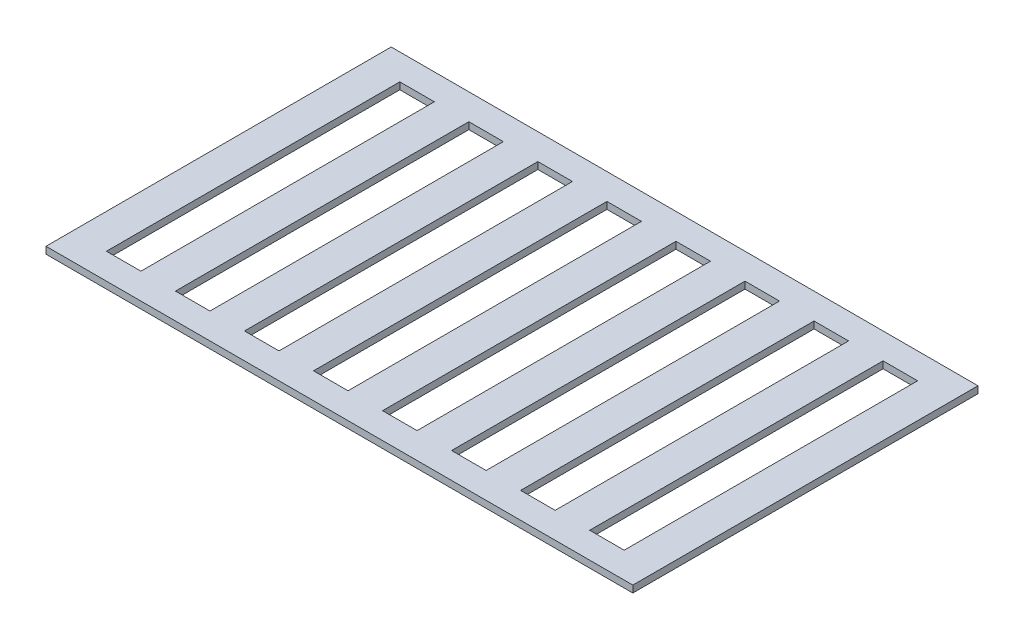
ISO-10303-21;
HEADER;
FILE_DESCRIPTION(('STEP AP214'),'2;1');
FILE_NAME('part.step','',(''),(''),'','','');
FILE_SCHEMA(('AUTOMOTIVE_DESIGN { 1 0 10303 214 1 1 1 1 }'));
ENDSEC;
DATA;
#1=APPLICATION_CONTEXT('core data for automotive mechanical design processes');
#2=APPLICATION_PROTOCOL_DEFINITION('international standard','automotive_design',2000,#1);
#3=PRODUCT_CONTEXT('',#1,'mechanical');
#4=PRODUCT('Part','Part','',(#3));
#5=PRODUCT_RELATED_PRODUCT_CATEGORY('part','',(#4));
#6=PRODUCT_DEFINITION_FORMATION('','',#4);
#7=PRODUCT_DEFINITION_CONTEXT('part definition',#1,'design');
#8=PRODUCT_DEFINITION('design','',#6,#7);
#9=PRODUCT_DEFINITION_SHAPE('','',#8);
#10=(LENGTH_UNIT() NAMED_UNIT(*) SI_UNIT(.MILLI.,.METRE.));
#11=(NAMED_UNIT(*) PLANE_ANGLE_UNIT() SI_UNIT($,.RADIAN.));
#12=(NAMED_UNIT(*) SI_UNIT($,.STERADIAN.) SOLID_ANGLE_UNIT());
#13=UNCERTAINTY_MEASURE_WITH_UNIT(LENGTH_MEASURE(1.E-05),#10,'distance_accuracy_value','');
#14=(GEOMETRIC_REPRESENTATION_CONTEXT(3) GLOBAL_UNCERTAINTY_ASSIGNED_CONTEXT((#13)) GLOBAL_UNIT_ASSIGNED_CONTEXT((#10,
#11,#12)) REPRESENTATION_CONTEXT('',''));
#15=CARTESIAN_POINT('',(0.,0.,0.));
#16=DIRECTION('',(0.,0.,1.));
#17=DIRECTION('',(1.,0.,0.));
#18=AXIS2_PLACEMENT_3D('',#15,#16,#17);
#19=CARTESIAN_POINT('',(0.,5.08,254.));
#20=DIRECTION('',(0.,1.,0.));
#21=DIRECTION('',(0.,0.,1.));
#22=AXIS2_PLACEMENT_3D('',#19,#20,#21);
#23=PLANE('',#22);
#24=DIRECTION('',(0.,0.,1.));
#25=VECTOR('',#24,1.);
#26=CARTESIAN_POINT('',(279.4,5.08,19.05));
#27=LINE('',#26,#25);
#28=CARTESIAN_POINT('',(279.4,5.08,19.05));
#29=VERTEX_POINT('',#28);
#30=CARTESIAN_POINT('',(279.4,5.08,234.95));
#31=VERTEX_POINT('',#30);
#32=EDGE_CURVE('E302',#29,#31,#27,.T.);
#33=ORIENTED_EDGE('',*,*,#32,.F.);
#34=DIRECTION('',(-1.,0.,0.));
#35=VECTOR('',#34,1.);
#36=CARTESIAN_POINT('',(279.4,5.08,19.05));
#37=LINE('',#36,#35);
#38=CARTESIAN_POINT('',(304.8,5.08,19.05));
#39=VERTEX_POINT('',#38);
#40=EDGE_CURVE('E300',#39,#29,#37,.T.);
#41=ORIENTED_EDGE('',*,*,#40,.F.);
#42=DIRECTION('',(0.,0.,-1.));
#43=VECTOR('',#42,1.);
#44=CARTESIAN_POINT('',(304.8,5.08,19.05));
#45=LINE('',#44,#43);
#46=CARTESIAN_POINT('',(304.8,5.08,234.95));
#47=VERTEX_POINT('',#46);
#48=EDGE_CURVE('E308',#47,#39,#45,.T.);
#49=ORIENTED_EDGE('',*,*,#48,.F.);
#50=DIRECTION('',(1.,0.,0.));
#51=VECTOR('',#50,1.);
#52=CARTESIAN_POINT('',(279.4,5.08,234.95));
#53=LINE('',#52,#51);
#54=EDGE_CURVE('E305',#31,#47,#53,.T.);
#55=ORIENTED_EDGE('',*,*,#54,.F.);
#56=EDGE_LOOP('',(#33,#41,#49,#55));
#57=FACE_BOUND('',#56,.T.);
#58=DIRECTION('',(0.,0.,1.));
#59=VECTOR('',#58,1.);
#60=CARTESIAN_POINT('',(177.8,5.08,19.05));
#61=LINE('',#60,#59);
#62=CARTESIAN_POINT('',(177.8,5.08,19.05));
#63=VERTEX_POINT('',#62);
#64=CARTESIAN_POINT('',(177.8,5.08,234.95));
#65=VERTEX_POINT('',#64);
#66=EDGE_CURVE('E364',#63,#65,#61,.T.);
#67=ORIENTED_EDGE('',*,*,#66,.F.);
#68=DIRECTION('',(-1.,0.,0.));
#69=VECTOR('',#68,1.);
#70=CARTESIAN_POINT('',(177.8,5.08,19.05));
#71=LINE('',#70,#69);
#72=CARTESIAN_POINT('',(203.2,5.08,19.05));
#73=VERTEX_POINT('',#72);
#74=EDGE_CURVE('E362',#73,#63,#71,.T.);
#75=ORIENTED_EDGE('',*,*,#74,.F.);
#76=DIRECTION('',(0.,0.,-1.));
#77=VECTOR('',#76,1.);
#78=CARTESIAN_POINT('',(203.2,5.08,19.05));
#79=LINE('',#78,#77);
#80=CARTESIAN_POINT('',(203.2,5.08,234.95));
#81=VERTEX_POINT('',#80);
#82=EDGE_CURVE('E370',#81,#73,#79,.T.);
#83=ORIENTED_EDGE('',*,*,#82,.F.);
#84=DIRECTION('',(1.,0.,0.));
#85=VECTOR('',#84,1.);
#86=CARTESIAN_POINT('',(177.8,5.08,234.95));
#87=LINE('',#86,#85);
#88=EDGE_CURVE('E367',#65,#81,#87,.T.);
#89=ORIENTED_EDGE('',*,*,#88,.F.);
#90=EDGE_LOOP('',(#67,#75,#83,#89));
#91=FACE_BOUND('',#90,.T.);
#92=DIRECTION('',(0.,0.,1.));
#93=VECTOR('',#92,1.);
#94=CARTESIAN_POINT('',(76.2,5.08,19.05));
#95=LINE('',#94,#93);
#96=CARTESIAN_POINT('',(76.2,5.08,19.05));
#97=VERTEX_POINT('',#96);
#98=CARTESIAN_POINT('',(76.2,5.08,234.95));
#99=VERTEX_POINT('',#98);
#100=EDGE_CURVE('E426',#97,#99,#95,.T.);
#101=ORIENTED_EDGE('',*,*,#100,.F.);
#102=DIRECTION('',(-1.,0.,0.));
#103=VECTOR('',#102,1.);
#104=CARTESIAN_POINT('',(76.2,5.08,19.05));
#105=LINE('',#104,#103);
#106=CARTESIAN_POINT('',(101.6,5.08,19.05));
#107=VERTEX_POINT('',#106);
#108=EDGE_CURVE('E424',#107,#97,#105,.T.);
#109=ORIENTED_EDGE('',*,*,#108,.F.);
#110=DIRECTION('',(0.,0.,-1.));
#111=VECTOR('',#110,1.);
#112=CARTESIAN_POINT('',(101.6,5.08,19.05));
#113=LINE('',#112,#111);
#114=CARTESIAN_POINT('',(101.6,5.08,234.95));
#115=VERTEX_POINT('',#114);
#116=EDGE_CURVE('E432',#115,#107,#113,.T.);
#117=ORIENTED_EDGE('',*,*,#116,.F.);
#118=DIRECTION('',(1.,0.,0.));
#119=VECTOR('',#118,1.);
#120=CARTESIAN_POINT('',(76.2,5.08,234.95));
#121=LINE('',#120,#119);
#122=EDGE_CURVE('E429',#99,#115,#121,.T.);
#123=ORIENTED_EDGE('',*,*,#122,.F.);
#124=EDGE_LOOP('',(#101,#109,#117,#123));
#125=FACE_BOUND('',#124,.T.);
#126=DIRECTION('',(1.,0.,0.));
#127=VECTOR('',#126,1.);
#128=CARTESIAN_POINT('',(25.4,5.08,234.95));
#129=LINE('',#128,#127);
#130=CARTESIAN_POINT('',(25.4,5.08,234.95));
#131=VERTEX_POINT('',#130);
#132=CARTESIAN_POINT('',(50.8,5.08,234.95));
#133=VERTEX_POINT('',#132);
#134=EDGE_CURVE('E488',#131,#133,#129,.T.);
#135=ORIENTED_EDGE('',*,*,#134,.F.);
#136=DIRECTION('',(0.,0.,1.));
#137=VECTOR('',#136,1.);
#138=CARTESIAN_POINT('',(25.4,5.08,19.05));
#139=LINE('',#138,#137);
#140=CARTESIAN_POINT('',(25.4,5.08,19.05));
#141=VERTEX_POINT('',#140);
#142=EDGE_CURVE('E486',#141,#131,#139,.T.);
#143=ORIENTED_EDGE('',*,*,#142,.F.);
#144=DIRECTION('',(-1.,0.,0.));
#145=VECTOR('',#144,1.);
#146=CARTESIAN_POINT('',(25.4,5.08,19.05));
#147=LINE('',#146,#145);
#148=CARTESIAN_POINT('',(50.8,5.08,19.05));
#149=VERTEX_POINT('',#148);
#150=EDGE_CURVE('E494',#149,#141,#147,.T.);
#151=ORIENTED_EDGE('',*,*,#150,.F.);
#152=DIRECTION('',(0.,0.,-1.));
#153=VECTOR('',#152,1.);
#154=CARTESIAN_POINT('',(50.8,5.08,19.05));
#155=LINE('',#154,#153);
#156=EDGE_CURVE('E491',#133,#149,#155,.T.);
#157=ORIENTED_EDGE('',*,*,#156,.F.);
#158=EDGE_LOOP('',(#135,#143,#151,#157));
#159=FACE_BOUND('',#158,.T.);
#160=DIRECTION('',(0.,0.,1.));
#161=VECTOR('',#160,1.);
#162=CARTESIAN_POINT('',(0.,5.08,0.));
#163=LINE('',#162,#161);
#164=CARTESIAN_POINT('',(0.,5.08,0.));
#165=VERTEX_POINT('',#164);
#166=CARTESIAN_POINT('',(0.,5.08,254.));
#167=VERTEX_POINT('',#166);
#168=EDGE_CURVE('E517',#165,#167,#163,.T.);
#169=ORIENTED_EDGE('',*,*,#168,.T.);
#170=DIRECTION('',(1.,0.,0.));
#171=VECTOR('',#170,1.);
#172=CARTESIAN_POINT('',(0.,5.08,254.));
#173=LINE('',#172,#171);
#174=CARTESIAN_POINT('',(431.8,5.08,254.));
#175=VERTEX_POINT('',#174);
#176=EDGE_CURVE('E520',#167,#175,#173,.T.);
#177=ORIENTED_EDGE('',*,*,#176,.T.);
#178=DIRECTION('',(0.,0.,-1.));
#179=VECTOR('',#178,1.);
#180=CARTESIAN_POINT('',(431.8,5.08,0.));
#181=LINE('',#180,#179);
#182=CARTESIAN_POINT('',(431.8,5.08,0.));
#183=VERTEX_POINT('',#182);
#184=EDGE_CURVE('E523',#175,#183,#181,.T.);
#185=ORIENTED_EDGE('',*,*,#184,.T.);
#186=DIRECTION('',(-1.,0.,0.));
#187=VECTOR('',#186,1.);
#188=CARTESIAN_POINT('',(0.,5.08,0.));
#189=LINE('',#188,#187);
#190=EDGE_CURVE('E525',#183,#165,#189,.T.);
#191=ORIENTED_EDGE('',*,*,#190,.T.);
#192=EDGE_LOOP('',(#169,#177,#185,#191));
#193=FACE_BOUND('',#192,.T.);
#194=DIRECTION('',(0.,0.,-1.));
#195=VECTOR('',#194,1.);
#196=CARTESIAN_POINT('',(406.4,5.08,19.05));
#197=LINE('',#196,#195);
#198=CARTESIAN_POINT('',(406.4,5.08,234.95));
#199=VERTEX_POINT('',#198);
#200=CARTESIAN_POINT('',(406.4,5.08,19.05));
#201=VERTEX_POINT('',#200);
#202=EDGE_CURVE('E457',#199,#201,#197,.T.);
#203=ORIENTED_EDGE('',*,*,#202,.F.);
#204=DIRECTION('',(1.,0.,0.));
#205=VECTOR('',#204,1.);
#206=CARTESIAN_POINT('',(381.,5.08,234.95));
#207=LINE('',#206,#205);
#208=CARTESIAN_POINT('',(381.,5.08,234.95));
#209=VERTEX_POINT('',#208);
#210=EDGE_CURVE('E455',#209,#199,#207,.T.);
#211=ORIENTED_EDGE('',*,*,#210,.F.);
#212=DIRECTION('',(0.,0.,1.));
#213=VECTOR('',#212,1.);
#214=CARTESIAN_POINT('',(381.,5.08,19.05));
#215=LINE('',#214,#213);
#216=CARTESIAN_POINT('',(381.,5.08,19.05));
#217=VERTEX_POINT('',#216);
#218=EDGE_CURVE('E463',#217,#209,#215,.T.);
#219=ORIENTED_EDGE('',*,*,#218,.F.);
#220=DIRECTION('',(-1.,0.,0.));
#221=VECTOR('',#220,1.);
#222=CARTESIAN_POINT('',(381.,5.08,19.05));
#223=LINE('',#222,#221);
#224=EDGE_CURVE('E460',#201,#217,#223,.T.);
#225=ORIENTED_EDGE('',*,*,#224,.F.);
#226=EDGE_LOOP('',(#203,#211,#219,#225));
#227=FACE_BOUND('',#226,.T.);
#228=DIRECTION('',(0.,0.,1.));
#229=VECTOR('',#228,1.);
#230=CARTESIAN_POINT('',(127.,5.08,19.05));
#231=LINE('',#230,#229);
#232=CARTESIAN_POINT('',(127.,5.08,19.05));
#233=VERTEX_POINT('',#232);
#234=CARTESIAN_POINT('',(127.,5.08,234.95));
#235=VERTEX_POINT('',#234);
#236=EDGE_CURVE('E395',#233,#235,#231,.T.);
#237=ORIENTED_EDGE('',*,*,#236,.F.);
#238=DIRECTION('',(-1.,0.,0.));
#239=VECTOR('',#238,1.);
#240=CARTESIAN_POINT('',(127.,5.08,19.05));
#241=LINE('',#240,#239);
#242=CARTESIAN_POINT('',(152.4,5.08,19.05));
#243=VERTEX_POINT('',#242);
#244=EDGE_CURVE('E393',#243,#233,#241,.T.);
#245=ORIENTED_EDGE('',*,*,#244,.F.);
#246=DIRECTION('',(0.,0.,-1.));
#247=VECTOR('',#246,1.);
#248=CARTESIAN_POINT('',(152.4,5.08,19.05));
#249=LINE('',#248,#247);
#250=CARTESIAN_POINT('',(152.4,5.08,234.95));
#251=VERTEX_POINT('',#250);
#252=EDGE_CURVE('E401',#251,#243,#249,.T.);
#253=ORIENTED_EDGE('',*,*,#252,.F.);
#254=DIRECTION('',(1.,0.,0.));
#255=VECTOR('',#254,1.);
#256=CARTESIAN_POINT('',(127.,5.08,234.95));
#257=LINE('',#256,#255);
#258=EDGE_CURVE('E398',#235,#251,#257,.T.);
#259=ORIENTED_EDGE('',*,*,#258,.F.);
#260=EDGE_LOOP('',(#237,#245,#253,#259));
#261=FACE_BOUND('',#260,.T.);
#262=DIRECTION('',(0.,0.,1.));
#263=VECTOR('',#262,1.);
#264=CARTESIAN_POINT('',(228.6,5.08,19.05));
#265=LINE('',#264,#263);
#266=CARTESIAN_POINT('',(228.6,5.08,19.05));
#267=VERTEX_POINT('',#266);
#268=CARTESIAN_POINT('',(228.6,5.08,234.95));
#269=VERTEX_POINT('',#268);
#270=EDGE_CURVE('E333',#267,#269,#265,.T.);
#271=ORIENTED_EDGE('',*,*,#270,.F.);
#272=DIRECTION('',(-1.,0.,0.));
#273=VECTOR('',#272,1.);
#274=CARTESIAN_POINT('',(228.6,5.08,19.05));
#275=LINE('',#274,#273);
#276=CARTESIAN_POINT('',(254.,5.08,19.05));
#277=VERTEX_POINT('',#276);
#278=EDGE_CURVE('E331',#277,#267,#275,.T.);
#279=ORIENTED_EDGE('',*,*,#278,.F.);
#280=DIRECTION('',(0.,0.,-1.));
#281=VECTOR('',#280,1.);
#282=CARTESIAN_POINT('',(254.,5.08,19.05));
#283=LINE('',#282,#281);
#284=CARTESIAN_POINT('',(254.,5.08,234.95));
#285=VERTEX_POINT('',#284);
#286=EDGE_CURVE('E339',#285,#277,#283,.T.);
#287=ORIENTED_EDGE('',*,*,#286,.F.);
#288=DIRECTION('',(1.,0.,0.));
#289=VECTOR('',#288,1.);
#290=CARTESIAN_POINT('',(228.6,5.08,234.95));
#291=LINE('',#290,#289);
#292=EDGE_CURVE('E336',#269,#285,#291,.T.);
#293=ORIENTED_EDGE('',*,*,#292,.F.);
#294=EDGE_LOOP('',(#271,#279,#287,#293));
#295=FACE_BOUND('',#294,.T.);
#296=DIRECTION('',(0.,0.,1.));
#297=VECTOR('',#296,1.);
#298=CARTESIAN_POINT('',(330.2,5.08,19.05));
#299=LINE('',#298,#297);
#300=CARTESIAN_POINT('',(330.2,5.08,19.05));
#301=VERTEX_POINT('',#300);
#302=CARTESIAN_POINT('',(330.2,5.08,234.95));
#303=VERTEX_POINT('',#302);
#304=EDGE_CURVE('E272',#301,#303,#299,.T.);
#305=ORIENTED_EDGE('',*,*,#304,.F.);
#306=DIRECTION('',(-1.,0.,0.));
#307=VECTOR('',#306,1.);
#308=CARTESIAN_POINT('',(330.2,5.08,19.05));
#309=LINE('',#308,#307);
#310=CARTESIAN_POINT('',(355.6,5.08,19.05));
#311=VERTEX_POINT('',#310);
#312=EDGE_CURVE('E264',#311,#301,#309,.T.);
#313=ORIENTED_EDGE('',*,*,#312,.F.);
#314=DIRECTION('',(0.,0.,-1.));
#315=VECTOR('',#314,1.);
#316=CARTESIAN_POINT('',(355.6,5.08,19.05));
#317=LINE('',#316,#315);
#318=CARTESIAN_POINT('',(355.6,5.08,234.95));
#319=VERTEX_POINT('',#318);
#320=EDGE_CURVE('E286',#319,#311,#317,.T.);
#321=ORIENTED_EDGE('',*,*,#320,.F.);
#322=DIRECTION('',(1.,0.,0.));
#323=VECTOR('',#322,1.);
#324=CARTESIAN_POINT('',(330.2,5.08,234.95));
#325=LINE('',#324,#323);
#326=EDGE_CURVE('E284',#303,#319,#325,.T.);
#327=ORIENTED_EDGE('',*,*,#326,.F.);
#328=EDGE_LOOP('',(#305,#313,#321,#327));
#329=FACE_BOUND('',#328,.T.);
#330=ADVANCED_FACE('F31',(#57,#91,#125,#159,#193,#227,#261,#295,#329),#23,.T.);
#331=CARTESIAN_POINT('',(0.,0.,254.));
#332=DIRECTION('',(0.,1.,0.));
#333=DIRECTION('',(0.,0.,1.));
#334=AXIS2_PLACEMENT_3D('',#331,#332,#333);
#335=PLANE('',#334);
#336=DIRECTION('',(-1.,0.,0.));
#337=VECTOR('',#336,1.);
#338=CARTESIAN_POINT('',(279.4,0.,19.05));
#339=LINE('',#338,#337);
#340=CARTESIAN_POINT('',(304.8,0.,19.05));
#341=VERTEX_POINT('',#340);
#342=CARTESIAN_POINT('',(279.4,0.,19.05));
#343=VERTEX_POINT('',#342);
#344=EDGE_CURVE('E280',#341,#343,#339,.T.);
#345=ORIENTED_EDGE('',*,*,#344,.T.);
#346=DIRECTION('',(0.,0.,1.));
#347=VECTOR('',#346,1.);
#348=CARTESIAN_POINT('',(279.4,0.,19.05));
#349=LINE('',#348,#347);
#350=CARTESIAN_POINT('',(279.4,0.,234.95));
#351=VERTEX_POINT('',#350);
#352=EDGE_CURVE('E313',#343,#351,#349,.T.);
#353=ORIENTED_EDGE('',*,*,#352,.T.);
#354=DIRECTION('',(1.,0.,0.));
#355=VECTOR('',#354,1.);
#356=CARTESIAN_POINT('',(279.4,0.,234.95));
#357=LINE('',#356,#355);
#358=CARTESIAN_POINT('',(304.8,0.,234.95));
#359=VERTEX_POINT('',#358);
#360=EDGE_CURVE('E316',#351,#359,#357,.T.);
#361=ORIENTED_EDGE('',*,*,#360,.T.);
#362=DIRECTION('',(0.,0.,-1.));
#363=VECTOR('',#362,1.);
#364=CARTESIAN_POINT('',(304.8,0.,19.05));
#365=LINE('',#364,#363);
#366=EDGE_CURVE('E303',#359,#341,#365,.T.);
#367=ORIENTED_EDGE('',*,*,#366,.T.);
#368=EDGE_LOOP('',(#345,#353,#361,#367));
#369=FACE_BOUND('',#368,.T.);
#370=DIRECTION('',(-1.,0.,0.));
#371=VECTOR('',#370,1.);
#372=CARTESIAN_POINT('',(177.8,0.,19.05));
#373=LINE('',#372,#371);
#374=CARTESIAN_POINT('',(203.2,0.,19.05));
#375=VERTEX_POINT('',#374);
#376=CARTESIAN_POINT('',(177.8,0.,19.05));
#377=VERTEX_POINT('',#376);
#378=EDGE_CURVE('E361',#375,#377,#373,.T.);
#379=ORIENTED_EDGE('',*,*,#378,.T.);
#380=DIRECTION('',(0.,0.,1.));
#381=VECTOR('',#380,1.);
#382=CARTESIAN_POINT('',(177.8,0.,19.05));
#383=LINE('',#382,#381);
#384=CARTESIAN_POINT('',(177.8,0.,234.95));
#385=VERTEX_POINT('',#384);
#386=EDGE_CURVE('E375',#377,#385,#383,.T.);
#387=ORIENTED_EDGE('',*,*,#386,.T.);
#388=DIRECTION('',(1.,0.,0.));
#389=VECTOR('',#388,1.);
#390=CARTESIAN_POINT('',(177.8,0.,234.95));
#391=LINE('',#390,#389);
#392=CARTESIAN_POINT('',(203.2,0.,234.95));
#393=VERTEX_POINT('',#392);
#394=EDGE_CURVE('E378',#385,#393,#391,.T.);
#395=ORIENTED_EDGE('',*,*,#394,.T.);
#396=DIRECTION('',(0.,0.,-1.));
#397=VECTOR('',#396,1.);
#398=CARTESIAN_POINT('',(203.2,0.,19.05));
#399=LINE('',#398,#397);
#400=EDGE_CURVE('E365',#393,#375,#399,.T.);
#401=ORIENTED_EDGE('',*,*,#400,.T.);
#402=EDGE_LOOP('',(#379,#387,#395,#401));
#403=FACE_BOUND('',#402,.T.);
#404=DIRECTION('',(-1.,0.,0.));
#405=VECTOR('',#404,1.);
#406=CARTESIAN_POINT('',(76.2,0.,19.05));
#407=LINE('',#406,#405);
#408=CARTESIAN_POINT('',(101.6,0.,19.05));
#409=VERTEX_POINT('',#408);
#410=CARTESIAN_POINT('',(76.2,0.,19.05));
#411=VERTEX_POINT('',#410);
#412=EDGE_CURVE('E423',#409,#411,#407,.T.);
#413=ORIENTED_EDGE('',*,*,#412,.T.);
#414=DIRECTION('',(0.,0.,1.));
#415=VECTOR('',#414,1.);
#416=CARTESIAN_POINT('',(76.2,0.,19.05));
#417=LINE('',#416,#415);
#418=CARTESIAN_POINT('',(76.2,0.,234.95));
#419=VERTEX_POINT('',#418);
#420=EDGE_CURVE('E437',#411,#419,#417,.T.);
#421=ORIENTED_EDGE('',*,*,#420,.T.);
#422=DIRECTION('',(1.,0.,0.));
#423=VECTOR('',#422,1.);
#424=CARTESIAN_POINT('',(76.2,0.,234.95));
#425=LINE('',#424,#423);
#426=CARTESIAN_POINT('',(101.6,0.,234.95));
#427=VERTEX_POINT('',#426);
#428=EDGE_CURVE('E440',#419,#427,#425,.T.);
#429=ORIENTED_EDGE('',*,*,#428,.T.);
#430=DIRECTION('',(0.,0.,-1.));
#431=VECTOR('',#430,1.);
#432=CARTESIAN_POINT('',(101.6,0.,19.05));
#433=LINE('',#432,#431);
#434=EDGE_CURVE('E427',#427,#409,#433,.T.);
#435=ORIENTED_EDGE('',*,*,#434,.T.);
#436=EDGE_LOOP('',(#413,#421,#429,#435));
#437=FACE_BOUND('',#436,.T.);
#438=DIRECTION('',(0.,0.,1.));
#439=VECTOR('',#438,1.);
#440=CARTESIAN_POINT('',(25.4,0.,19.05));
#441=LINE('',#440,#439);
#442=CARTESIAN_POINT('',(25.4,0.,19.05));
#443=VERTEX_POINT('',#442);
#444=CARTESIAN_POINT('',(25.4,0.,234.95));
#445=VERTEX_POINT('',#444);
#446=EDGE_CURVE('E485',#443,#445,#441,.T.);
#447=ORIENTED_EDGE('',*,*,#446,.T.);
#448=DIRECTION('',(1.,0.,0.));
#449=VECTOR('',#448,1.);
#450=CARTESIAN_POINT('',(25.4,0.,234.95));
#451=LINE('',#450,#449);
#452=CARTESIAN_POINT('',(50.8,0.,234.95));
#453=VERTEX_POINT('',#452);
#454=EDGE_CURVE('E499',#445,#453,#451,.T.);
#455=ORIENTED_EDGE('',*,*,#454,.T.);
#456=DIRECTION('',(0.,0.,-1.));
#457=VECTOR('',#456,1.);
#458=CARTESIAN_POINT('',(50.8,0.,19.05));
#459=LINE('',#458,#457);
#460=CARTESIAN_POINT('',(50.8,0.,19.05));
#461=VERTEX_POINT('',#460);
#462=EDGE_CURVE('E502',#453,#461,#459,.T.);
#463=ORIENTED_EDGE('',*,*,#462,.T.);
#464=DIRECTION('',(-1.,0.,0.));
#465=VECTOR('',#464,1.);
#466=CARTESIAN_POINT('',(25.4,0.,19.05));
#467=LINE('',#466,#465);
#468=EDGE_CURVE('E489',#461,#443,#467,.T.);
#469=ORIENTED_EDGE('',*,*,#468,.T.);
#470=EDGE_LOOP('',(#447,#455,#463,#469));
#471=FACE_BOUND('',#470,.T.);
#472=DIRECTION('',(0.,0.,1.));
#473=VECTOR('',#472,1.);
#474=CARTESIAN_POINT('',(0.,0.,0.));
#475=LINE('',#474,#473);
#476=CARTESIAN_POINT('',(0.,0.,0.));
#477=VERTEX_POINT('',#476);
#478=CARTESIAN_POINT('',(0.,0.,254.));
#479=VERTEX_POINT('',#478);
#480=EDGE_CURVE('E516',#477,#479,#475,.T.);
#481=ORIENTED_EDGE('',*,*,#480,.F.);
#482=DIRECTION('',(-1.,0.,0.));
#483=VECTOR('',#482,1.);
#484=CARTESIAN_POINT('',(0.,0.,0.));
#485=LINE('',#484,#483);
#486=CARTESIAN_POINT('',(431.8,0.,0.));
#487=VERTEX_POINT('',#486);
#488=EDGE_CURVE('E521',#487,#477,#485,.T.);
#489=ORIENTED_EDGE('',*,*,#488,.F.);
#490=DIRECTION('',(0.,0.,-1.));
#491=VECTOR('',#490,1.);
#492=CARTESIAN_POINT('',(431.8,0.,0.));
#493=LINE('',#492,#491);
#494=CARTESIAN_POINT('',(431.8,0.,254.));
#495=VERTEX_POINT('',#494);
#496=EDGE_CURVE('E532',#495,#487,#493,.T.);
#497=ORIENTED_EDGE('',*,*,#496,.F.);
#498=DIRECTION('',(1.,0.,0.));
#499=VECTOR('',#498,1.);
#500=CARTESIAN_POINT('',(0.,0.,254.));
#501=LINE('',#500,#499);
#502=EDGE_CURVE('E530',#479,#495,#501,.T.);
#503=ORIENTED_EDGE('',*,*,#502,.F.);
#504=EDGE_LOOP('',(#481,#489,#497,#503));
#505=FACE_BOUND('',#504,.T.);
#506=DIRECTION('',(1.,0.,0.));
#507=VECTOR('',#506,1.);
#508=CARTESIAN_POINT('',(381.,0.,234.95));
#509=LINE('',#508,#507);
#510=CARTESIAN_POINT('',(381.,0.,234.95));
#511=VERTEX_POINT('',#510);
#512=CARTESIAN_POINT('',(406.4,0.,234.95));
#513=VERTEX_POINT('',#512);
#514=EDGE_CURVE('E454',#511,#513,#509,.T.);
#515=ORIENTED_EDGE('',*,*,#514,.T.);
#516=DIRECTION('',(0.,0.,-1.));
#517=VECTOR('',#516,1.);
#518=CARTESIAN_POINT('',(406.4,0.,19.05));
#519=LINE('',#518,#517);
#520=CARTESIAN_POINT('',(406.4,0.,19.05));
#521=VERTEX_POINT('',#520);
#522=EDGE_CURVE('E468',#513,#521,#519,.T.);
#523=ORIENTED_EDGE('',*,*,#522,.T.);
#524=DIRECTION('',(-1.,0.,0.));
#525=VECTOR('',#524,1.);
#526=CARTESIAN_POINT('',(381.,0.,19.05));
#527=LINE('',#526,#525);
#528=CARTESIAN_POINT('',(381.,0.,19.05));
#529=VERTEX_POINT('',#528);
#530=EDGE_CURVE('E471',#521,#529,#527,.T.);
#531=ORIENTED_EDGE('',*,*,#530,.T.);
#532=DIRECTION('',(0.,0.,1.));
#533=VECTOR('',#532,1.);
#534=CARTESIAN_POINT('',(381.,0.,19.05));
#535=LINE('',#534,#533);
#536=EDGE_CURVE('E458',#529,#511,#535,.T.);
#537=ORIENTED_EDGE('',*,*,#536,.T.);
#538=EDGE_LOOP('',(#515,#523,#531,#537));
#539=FACE_BOUND('',#538,.T.);
#540=DIRECTION('',(-1.,0.,0.));
#541=VECTOR('',#540,1.);
#542=CARTESIAN_POINT('',(127.,0.,19.05));
#543=LINE('',#542,#541);
#544=CARTESIAN_POINT('',(152.4,0.,19.05));
#545=VERTEX_POINT('',#544);
#546=CARTESIAN_POINT('',(127.,0.,19.05));
#547=VERTEX_POINT('',#546);
#548=EDGE_CURVE('E392',#545,#547,#543,.T.);
#549=ORIENTED_EDGE('',*,*,#548,.T.);
#550=DIRECTION('',(0.,0.,1.));
#551=VECTOR('',#550,1.);
#552=CARTESIAN_POINT('',(127.,0.,19.05));
#553=LINE('',#552,#551);
#554=CARTESIAN_POINT('',(127.,0.,234.95));
#555=VERTEX_POINT('',#554);
#556=EDGE_CURVE('E406',#547,#555,#553,.T.);
#557=ORIENTED_EDGE('',*,*,#556,.T.);
#558=DIRECTION('',(1.,0.,0.));
#559=VECTOR('',#558,1.);
#560=CARTESIAN_POINT('',(127.,0.,234.95));
#561=LINE('',#560,#559);
#562=CARTESIAN_POINT('',(152.4,0.,234.95));
#563=VERTEX_POINT('',#562);
#564=EDGE_CURVE('E409',#555,#563,#561,.T.);
#565=ORIENTED_EDGE('',*,*,#564,.T.);
#566=DIRECTION('',(0.,0.,-1.));
#567=VECTOR('',#566,1.);
#568=CARTESIAN_POINT('',(152.4,0.,19.05));
#569=LINE('',#568,#567);
#570=EDGE_CURVE('E396',#563,#545,#569,.T.);
#571=ORIENTED_EDGE('',*,*,#570,.T.);
#572=EDGE_LOOP('',(#549,#557,#565,#571));
#573=FACE_BOUND('',#572,.T.);
#574=DIRECTION('',(-1.,0.,0.));
#575=VECTOR('',#574,1.);
#576=CARTESIAN_POINT('',(228.6,0.,19.05));
#577=LINE('',#576,#575);
#578=CARTESIAN_POINT('',(254.,0.,19.05));
#579=VERTEX_POINT('',#578);
#580=CARTESIAN_POINT('',(228.6,0.,19.05));
#581=VERTEX_POINT('',#580);
#582=EDGE_CURVE('E330',#579,#581,#577,.T.);
#583=ORIENTED_EDGE('',*,*,#582,.T.);
#584=DIRECTION('',(0.,0.,1.));
#585=VECTOR('',#584,1.);
#586=CARTESIAN_POINT('',(228.6,0.,19.05));
#587=LINE('',#586,#585);
#588=CARTESIAN_POINT('',(228.6,0.,234.95));
#589=VERTEX_POINT('',#588);
#590=EDGE_CURVE('E344',#581,#589,#587,.T.);
#591=ORIENTED_EDGE('',*,*,#590,.T.);
#592=DIRECTION('',(1.,0.,0.));
#593=VECTOR('',#592,1.);
#594=CARTESIAN_POINT('',(228.6,0.,234.95));
#595=LINE('',#594,#593);
#596=CARTESIAN_POINT('',(254.,0.,234.95));
#597=VERTEX_POINT('',#596);
#598=EDGE_CURVE('E347',#589,#597,#595,.T.);
#599=ORIENTED_EDGE('',*,*,#598,.T.);
#600=DIRECTION('',(0.,0.,-1.));
#601=VECTOR('',#600,1.);
#602=CARTESIAN_POINT('',(254.,0.,19.05));
#603=LINE('',#602,#601);
#604=EDGE_CURVE('E334',#597,#579,#603,.T.);
#605=ORIENTED_EDGE('',*,*,#604,.T.);
#606=EDGE_LOOP('',(#583,#591,#599,#605));
#607=FACE_BOUND('',#606,.T.);
#608=DIRECTION('',(-1.,0.,0.));
#609=VECTOR('',#608,1.);
#610=CARTESIAN_POINT('',(330.2,0.,19.05));
#611=LINE('',#610,#609);
#612=CARTESIAN_POINT('',(355.6,0.,19.05));
#613=VERTEX_POINT('',#612);
#614=CARTESIAN_POINT('',(330.2,0.,19.05));
#615=VERTEX_POINT('',#614);
#616=EDGE_CURVE('E54',#613,#615,#611,.T.);
#617=ORIENTED_EDGE('',*,*,#616,.T.);
#618=DIRECTION('',(0.,0.,1.));
#619=VECTOR('',#618,1.);
#620=CARTESIAN_POINT('',(330.2,0.,19.05));
#621=LINE('',#620,#619);
#622=CARTESIAN_POINT('',(330.2,0.,234.95));
#623=VERTEX_POINT('',#622);
#624=EDGE_CURVE('E279',#615,#623,#621,.T.);
#625=ORIENTED_EDGE('',*,*,#624,.T.);
#626=DIRECTION('',(1.,0.,0.));
#627=VECTOR('',#626,1.);
#628=CARTESIAN_POINT('',(330.2,0.,234.95));
#629=LINE('',#628,#627);
#630=CARTESIAN_POINT('',(355.6,0.,234.95));
#631=VERTEX_POINT('',#630);
#632=EDGE_CURVE('E292',#623,#631,#629,.T.);
#633=ORIENTED_EDGE('',*,*,#632,.T.);
#634=DIRECTION('',(0.,0.,-1.));
#635=VECTOR('',#634,1.);
#636=CARTESIAN_POINT('',(355.6,0.,19.05));
#637=LINE('',#636,#635);
#638=EDGE_CURVE('E273',#631,#613,#637,.T.);
#639=ORIENTED_EDGE('',*,*,#638,.T.);
#640=EDGE_LOOP('',(#617,#625,#633,#639));
#641=FACE_BOUND('',#640,.T.);
#642=ADVANCED_FACE('F550',(#369,#403,#437,#471,#505,#539,#573,#607,#641),#335,.F.);
#643=CARTESIAN_POINT('',(0.,5.08,0.));
#644=DIRECTION('',(1.,0.,0.));
#645=DIRECTION('',(0.,0.,-1.));
#646=AXIS2_PLACEMENT_3D('',#643,#644,#645);
#647=PLANE('',#646);
#648=ORIENTED_EDGE('',*,*,#480,.T.);
#649=DIRECTION('',(0.,-1.,0.));
#650=VECTOR('',#649,1.);
#651=CARTESIAN_POINT('',(0.,5.08,254.));
#652=LINE('',#651,#650);
#653=EDGE_CURVE('E11',#167,#479,#652,.T.);
#654=ORIENTED_EDGE('',*,*,#653,.F.);
#655=ORIENTED_EDGE('',*,*,#168,.F.);
#656=DIRECTION('',(0.,-1.,0.));
#657=VECTOR('',#656,1.);
#658=CARTESIAN_POINT('',(0.,5.08,0.));
#659=LINE('',#658,#657);
#660=EDGE_CURVE('E527',#165,#477,#659,.T.);
#661=ORIENTED_EDGE('',*,*,#660,.T.);
#662=EDGE_LOOP('',(#648,#654,#655,#661));
#663=FACE_BOUND('',#662,.T.);
#664=ADVANCED_FACE('F33',(#663),#647,.F.);
#665=CARTESIAN_POINT('',(0.,5.08,254.));
#666=DIRECTION('',(0.,0.,-1.));
#667=DIRECTION('',(-1.,0.,0.));
#668=AXIS2_PLACEMENT_3D('',#665,#666,#667);
#669=PLANE('',#668);
#670=ORIENTED_EDGE('',*,*,#502,.T.);
#671=DIRECTION('',(0.,-1.,0.));
#672=VECTOR('',#671,1.);
#673=CARTESIAN_POINT('',(431.8,5.08,254.));
#674=LINE('',#673,#672);
#675=EDGE_CURVE('E39',#175,#495,#674,.T.);
#676=ORIENTED_EDGE('',*,*,#675,.F.);
#677=ORIENTED_EDGE('',*,*,#176,.F.);
#678=ORIENTED_EDGE('',*,*,#653,.T.);
#679=EDGE_LOOP('',(#670,#676,#677,#678));
#680=FACE_BOUND('',#679,.T.);
#681=ADVANCED_FACE('F561',(#680),#669,.F.);
#682=CARTESIAN_POINT('',(431.8,5.08,0.));
#683=DIRECTION('',(-1.,0.,0.));
#684=DIRECTION('',(0.,0.,1.));
#685=AXIS2_PLACEMENT_3D('',#682,#683,#684);
#686=PLANE('',#685);
#687=ORIENTED_EDGE('',*,*,#496,.T.);
#688=DIRECTION('',(0.,-1.,0.));
#689=VECTOR('',#688,1.);
#690=CARTESIAN_POINT('',(431.8,5.08,0.));
#691=LINE('',#690,#689);
#692=EDGE_CURVE('E537',#183,#487,#691,.T.);
#693=ORIENTED_EDGE('',*,*,#692,.F.);
#694=ORIENTED_EDGE('',*,*,#184,.F.);
#695=ORIENTED_EDGE('',*,*,#675,.T.);
#696=EDGE_LOOP('',(#687,#693,#694,#695));
#697=FACE_BOUND('',#696,.T.);
#698=ADVANCED_FACE('F544',(#697),#686,.F.);
#699=CARTESIAN_POINT('',(0.,5.08,0.));
#700=DIRECTION('',(0.,0.,1.));
#701=DIRECTION('',(1.,0.,0.));
#702=AXIS2_PLACEMENT_3D('',#699,#700,#701);
#703=PLANE('',#702);
#704=ORIENTED_EDGE('',*,*,#488,.T.);
#705=ORIENTED_EDGE('',*,*,#660,.F.);
#706=ORIENTED_EDGE('',*,*,#190,.F.);
#707=ORIENTED_EDGE('',*,*,#692,.T.);
#708=EDGE_LOOP('',(#704,#705,#706,#707));
#709=FACE_BOUND('',#708,.T.);
#710=ADVANCED_FACE('F554',(#709),#703,.F.);
#711=CARTESIAN_POINT('',(25.4,5.08,19.05));
#712=DIRECTION('',(1.,0.,0.));
#713=DIRECTION('',(0.,0.,-1.));
#714=AXIS2_PLACEMENT_3D('',#711,#712,#713);
#715=PLANE('',#714);
#716=ORIENTED_EDGE('',*,*,#446,.F.);
#717=DIRECTION('',(0.,-1.,0.));
#718=VECTOR('',#717,1.);
#719=CARTESIAN_POINT('',(25.4,5.08,19.05));
#720=LINE('',#719,#718);
#721=EDGE_CURVE('E496',#141,#443,#720,.T.);
#722=ORIENTED_EDGE('',*,*,#721,.F.);
#723=ORIENTED_EDGE('',*,*,#142,.T.);
#724=DIRECTION('',(0.,-1.,0.));
#725=VECTOR('',#724,1.);
#726=CARTESIAN_POINT('',(25.4,5.08,234.95));
#727=LINE('',#726,#725);
#728=EDGE_CURVE('E513',#131,#445,#727,.T.);
#729=ORIENTED_EDGE('',*,*,#728,.T.);
#730=EDGE_LOOP('',(#716,#722,#723,#729));
#731=FACE_BOUND('',#730,.T.);
#732=ADVANCED_FACE('F579',(#731),#715,.T.);
#733=CARTESIAN_POINT('',(25.4,5.08,234.95));
#734=DIRECTION('',(0.,0.,-1.));
#735=DIRECTION('',(-1.,0.,0.));
#736=AXIS2_PLACEMENT_3D('',#733,#734,#735);
#737=PLANE('',#736);
#738=ORIENTED_EDGE('',*,*,#454,.F.);
#739=ORIENTED_EDGE('',*,*,#728,.F.);
#740=ORIENTED_EDGE('',*,*,#134,.T.);
#741=DIRECTION('',(0.,-1.,0.));
#742=VECTOR('',#741,1.);
#743=CARTESIAN_POINT('',(50.8,5.08,234.95));
#744=LINE('',#743,#742);
#745=EDGE_CURVE('E511',#133,#453,#744,.T.);
#746=ORIENTED_EDGE('',*,*,#745,.T.);
#747=EDGE_LOOP('',(#738,#739,#740,#746));
#748=FACE_BOUND('',#747,.T.);
#749=ADVANCED_FACE('F586',(#748),#737,.T.);
#750=CARTESIAN_POINT('',(50.8,5.08,19.05));
#751=DIRECTION('',(-1.,0.,0.));
#752=DIRECTION('',(0.,0.,1.));
#753=AXIS2_PLACEMENT_3D('',#750,#751,#752);
#754=PLANE('',#753);
#755=ORIENTED_EDGE('',*,*,#462,.F.);
#756=ORIENTED_EDGE('',*,*,#745,.F.);
#757=ORIENTED_EDGE('',*,*,#156,.T.);
#758=DIRECTION('',(0.,-1.,0.));
#759=VECTOR('',#758,1.);
#760=CARTESIAN_POINT('',(50.8,5.08,19.05));
#761=LINE('',#760,#759);
#762=EDGE_CURVE('E509',#149,#461,#761,.T.);
#763=ORIENTED_EDGE('',*,*,#762,.T.);
#764=EDGE_LOOP('',(#755,#756,#757,#763));
#765=FACE_BOUND('',#764,.T.);
#766=ADVANCED_FACE('F591',(#765),#754,.T.);
#767=CARTESIAN_POINT('',(25.4,5.08,19.05));
#768=DIRECTION('',(0.,0.,1.));
#769=DIRECTION('',(1.,0.,0.));
#770=AXIS2_PLACEMENT_3D('',#767,#768,#769);
#771=PLANE('',#770);
#772=ORIENTED_EDGE('',*,*,#468,.F.);
#773=ORIENTED_EDGE('',*,*,#762,.F.);
#774=ORIENTED_EDGE('',*,*,#150,.T.);
#775=ORIENTED_EDGE('',*,*,#721,.T.);
#776=EDGE_LOOP('',(#772,#773,#774,#775));
#777=FACE_BOUND('',#776,.T.);
#778=ADVANCED_FACE('F599',(#777),#771,.T.);
#779=CARTESIAN_POINT('',(381.,5.08,234.95));
#780=DIRECTION('',(0.,0.,-1.));
#781=DIRECTION('',(-1.,0.,0.));
#782=AXIS2_PLACEMENT_3D('',#779,#780,#781);
#783=PLANE('',#782);
#784=ORIENTED_EDGE('',*,*,#514,.F.);
#785=DIRECTION('',(0.,-1.,0.));
#786=VECTOR('',#785,1.);
#787=CARTESIAN_POINT('',(381.,5.08,234.95));
#788=LINE('',#787,#786);
#789=EDGE_CURVE('E465',#209,#511,#788,.T.);
#790=ORIENTED_EDGE('',*,*,#789,.F.);
#791=ORIENTED_EDGE('',*,*,#210,.T.);
#792=DIRECTION('',(0.,-1.,0.));
#793=VECTOR('',#792,1.);
#794=CARTESIAN_POINT('',(406.4,5.08,234.95));
#795=LINE('',#794,#793);
#796=EDGE_CURVE('E482',#199,#513,#795,.T.);
#797=ORIENTED_EDGE('',*,*,#796,.T.);
#798=EDGE_LOOP('',(#784,#790,#791,#797));
#799=FACE_BOUND('',#798,.T.);
#800=ADVANCED_FACE('F612',(#799),#783,.T.);
#801=CARTESIAN_POINT('',(406.4,5.08,19.05));
#802=DIRECTION('',(-1.,0.,0.));
#803=DIRECTION('',(0.,0.,1.));
#804=AXIS2_PLACEMENT_3D('',#801,#802,#803);
#805=PLANE('',#804);
#806=ORIENTED_EDGE('',*,*,#522,.F.);
#807=ORIENTED_EDGE('',*,*,#796,.F.);
#808=ORIENTED_EDGE('',*,*,#202,.T.);
#809=DIRECTION('',(0.,-1.,0.));
#810=VECTOR('',#809,1.);
#811=CARTESIAN_POINT('',(406.4,5.08,19.05));
#812=LINE('',#811,#810);
#813=EDGE_CURVE('E480',#201,#521,#812,.T.);
#814=ORIENTED_EDGE('',*,*,#813,.T.);
#815=EDGE_LOOP('',(#806,#807,#808,#814));
#816=FACE_BOUND('',#815,.T.);
#817=ADVANCED_FACE('F617',(#816),#805,.T.);
#818=CARTESIAN_POINT('',(381.,5.08,19.05));
#819=DIRECTION('',(0.,0.,1.));
#820=DIRECTION('',(1.,0.,0.));
#821=AXIS2_PLACEMENT_3D('',#818,#819,#820);
#822=PLANE('',#821);
#823=ORIENTED_EDGE('',*,*,#530,.F.);
#824=ORIENTED_EDGE('',*,*,#813,.F.);
#825=ORIENTED_EDGE('',*,*,#224,.T.);
#826=DIRECTION('',(0.,-1.,0.));
#827=VECTOR('',#826,1.);
#828=CARTESIAN_POINT('',(381.,5.08,19.05));
#829=LINE('',#828,#827);
#830=EDGE_CURVE('E478',#217,#529,#829,.T.);
#831=ORIENTED_EDGE('',*,*,#830,.T.);
#832=EDGE_LOOP('',(#823,#824,#825,#831));
#833=FACE_BOUND('',#832,.T.);
#834=ADVANCED_FACE('F621',(#833),#822,.T.);
#835=CARTESIAN_POINT('',(381.,5.08,19.05));
#836=DIRECTION('',(1.,0.,0.));
#837=DIRECTION('',(0.,0.,-1.));
#838=AXIS2_PLACEMENT_3D('',#835,#836,#837);
#839=PLANE('',#838);
#840=ORIENTED_EDGE('',*,*,#536,.F.);
#841=ORIENTED_EDGE('',*,*,#830,.F.);
#842=ORIENTED_EDGE('',*,*,#218,.T.);
#843=ORIENTED_EDGE('',*,*,#789,.T.);
#844=EDGE_LOOP('',(#840,#841,#842,#843));
#845=FACE_BOUND('',#844,.T.);
#846=ADVANCED_FACE('F625',(#845),#839,.T.);
#847=CARTESIAN_POINT('',(76.2,5.08,19.05));
#848=DIRECTION('',(0.,0.,1.));
#849=DIRECTION('',(1.,0.,0.));
#850=AXIS2_PLACEMENT_3D('',#847,#848,#849);
#851=PLANE('',#850);
#852=ORIENTED_EDGE('',*,*,#412,.F.);
#853=DIRECTION('',(0.,-1.,0.));
#854=VECTOR('',#853,1.);
#855=CARTESIAN_POINT('',(101.6,5.08,19.05));
#856=LINE('',#855,#854);
#857=EDGE_CURVE('E434',#107,#409,#856,.T.);
#858=ORIENTED_EDGE('',*,*,#857,.F.);
#859=ORIENTED_EDGE('',*,*,#108,.T.);
#860=DIRECTION('',(0.,-1.,0.));
#861=VECTOR('',#860,1.);
#862=CARTESIAN_POINT('',(76.2,5.08,19.05));
#863=LINE('',#862,#861);
#864=EDGE_CURVE('E451',#97,#411,#863,.T.);
#865=ORIENTED_EDGE('',*,*,#864,.T.);
#866=EDGE_LOOP('',(#852,#858,#859,#865));
#867=FACE_BOUND('',#866,.T.);
#868=ADVANCED_FACE('F629',(#867),#851,.T.);
#869=CARTESIAN_POINT('',(76.2,5.08,19.05));
#870=DIRECTION('',(1.,0.,0.));
#871=DIRECTION('',(0.,0.,-1.));
#872=AXIS2_PLACEMENT_3D('',#869,#870,#871);
#873=PLANE('',#872);
#874=ORIENTED_EDGE('',*,*,#420,.F.);
#875=ORIENTED_EDGE('',*,*,#864,.F.);
#876=ORIENTED_EDGE('',*,*,#100,.T.);
#877=DIRECTION('',(0.,-1.,0.));
#878=VECTOR('',#877,1.);
#879=CARTESIAN_POINT('',(76.2,5.08,234.95));
#880=LINE('',#879,#878);
#881=EDGE_CURVE('E449',#99,#419,#880,.T.);
#882=ORIENTED_EDGE('',*,*,#881,.T.);
#883=EDGE_LOOP('',(#874,#875,#876,#882));
#884=FACE_BOUND('',#883,.T.);
#885=ADVANCED_FACE('F633',(#884),#873,.T.);
#886=CARTESIAN_POINT('',(76.2,5.08,234.95));
#887=DIRECTION('',(0.,0.,-1.));
#888=DIRECTION('',(-1.,0.,0.));
#889=AXIS2_PLACEMENT_3D('',#886,#887,#888);
#890=PLANE('',#889);
#891=ORIENTED_EDGE('',*,*,#428,.F.);
#892=ORIENTED_EDGE('',*,*,#881,.F.);
#893=ORIENTED_EDGE('',*,*,#122,.T.);
#894=DIRECTION('',(0.,-1.,0.));
#895=VECTOR('',#894,1.);
#896=CARTESIAN_POINT('',(101.6,5.08,234.95));
#897=LINE('',#896,#895);
#898=EDGE_CURVE('E447',#115,#427,#897,.T.);
#899=ORIENTED_EDGE('',*,*,#898,.T.);
#900=EDGE_LOOP('',(#891,#892,#893,#899));
#901=FACE_BOUND('',#900,.T.);
#902=ADVANCED_FACE('F637',(#901),#890,.T.);
#903=CARTESIAN_POINT('',(101.6,5.08,19.05));
#904=DIRECTION('',(-1.,0.,0.));
#905=DIRECTION('',(0.,0.,1.));
#906=AXIS2_PLACEMENT_3D('',#903,#904,#905);
#907=PLANE('',#906);
#908=ORIENTED_EDGE('',*,*,#434,.F.);
#909=ORIENTED_EDGE('',*,*,#898,.F.);
#910=ORIENTED_EDGE('',*,*,#116,.T.);
#911=ORIENTED_EDGE('',*,*,#857,.T.);
#912=EDGE_LOOP('',(#908,#909,#910,#911));
#913=FACE_BOUND('',#912,.T.);
#914=ADVANCED_FACE('F641',(#913),#907,.T.);
#915=CARTESIAN_POINT('',(127.,5.08,19.05));
#916=DIRECTION('',(0.,0.,1.));
#917=DIRECTION('',(1.,0.,0.));
#918=AXIS2_PLACEMENT_3D('',#915,#916,#917);
#919=PLANE('',#918);
#920=ORIENTED_EDGE('',*,*,#548,.F.);
#921=DIRECTION('',(0.,-1.,0.));
#922=VECTOR('',#921,1.);
#923=CARTESIAN_POINT('',(152.4,5.08,19.05));
#924=LINE('',#923,#922);
#925=EDGE_CURVE('E403',#243,#545,#924,.T.);
#926=ORIENTED_EDGE('',*,*,#925,.F.);
#927=ORIENTED_EDGE('',*,*,#244,.T.);
#928=DIRECTION('',(0.,-1.,0.));
#929=VECTOR('',#928,1.);
#930=CARTESIAN_POINT('',(127.,5.08,19.05));
#931=LINE('',#930,#929);
#932=EDGE_CURVE('E420',#233,#547,#931,.T.);
#933=ORIENTED_EDGE('',*,*,#932,.T.);
#934=EDGE_LOOP('',(#920,#926,#927,#933));
#935=FACE_BOUND('',#934,.T.);
#936=ADVANCED_FACE('F645',(#935),#919,.T.);
#937=CARTESIAN_POINT('',(127.,5.08,19.05));
#938=DIRECTION('',(1.,0.,0.));
#939=DIRECTION('',(0.,0.,-1.));
#940=AXIS2_PLACEMENT_3D('',#937,#938,#939);
#941=PLANE('',#940);
#942=ORIENTED_EDGE('',*,*,#556,.F.);
#943=ORIENTED_EDGE('',*,*,#932,.F.);
#944=ORIENTED_EDGE('',*,*,#236,.T.);
#945=DIRECTION('',(0.,-1.,0.));
#946=VECTOR('',#945,1.);
#947=CARTESIAN_POINT('',(127.,5.08,234.95));
#948=LINE('',#947,#946);
#949=EDGE_CURVE('E418',#235,#555,#948,.T.);
#950=ORIENTED_EDGE('',*,*,#949,.T.);
#951=EDGE_LOOP('',(#942,#943,#944,#950));
#952=FACE_BOUND('',#951,.T.);
#953=ADVANCED_FACE('F649',(#952),#941,.T.);
#954=CARTESIAN_POINT('',(127.,5.08,234.95));
#955=DIRECTION('',(0.,0.,-1.));
#956=DIRECTION('',(-1.,0.,0.));
#957=AXIS2_PLACEMENT_3D('',#954,#955,#956);
#958=PLANE('',#957);
#959=ORIENTED_EDGE('',*,*,#564,.F.);
#960=ORIENTED_EDGE('',*,*,#949,.F.);
#961=ORIENTED_EDGE('',*,*,#258,.T.);
#962=DIRECTION('',(0.,-1.,0.));
#963=VECTOR('',#962,1.);
#964=CARTESIAN_POINT('',(152.4,5.08,234.95));
#965=LINE('',#964,#963);
#966=EDGE_CURVE('E416',#251,#563,#965,.T.);
#967=ORIENTED_EDGE('',*,*,#966,.T.);
#968=EDGE_LOOP('',(#959,#960,#961,#967));
#969=FACE_BOUND('',#968,.T.);
#970=ADVANCED_FACE('F653',(#969),#958,.T.);
#971=CARTESIAN_POINT('',(152.4,5.08,19.05));
#972=DIRECTION('',(-1.,0.,0.));
#973=DIRECTION('',(0.,0.,1.));
#974=AXIS2_PLACEMENT_3D('',#971,#972,#973);
#975=PLANE('',#974);
#976=ORIENTED_EDGE('',*,*,#570,.F.);
#977=ORIENTED_EDGE('',*,*,#966,.F.);
#978=ORIENTED_EDGE('',*,*,#252,.T.);
#979=ORIENTED_EDGE('',*,*,#925,.T.);
#980=EDGE_LOOP('',(#976,#977,#978,#979));
#981=FACE_BOUND('',#980,.T.);
#982=ADVANCED_FACE('F657',(#981),#975,.T.);
#983=CARTESIAN_POINT('',(177.8,5.08,19.05));
#984=DIRECTION('',(0.,0.,1.));
#985=DIRECTION('',(1.,0.,0.));
#986=AXIS2_PLACEMENT_3D('',#983,#984,#985);
#987=PLANE('',#986);
#988=ORIENTED_EDGE('',*,*,#378,.F.);
#989=DIRECTION('',(0.,-1.,0.));
#990=VECTOR('',#989,1.);
#991=CARTESIAN_POINT('',(203.2,5.08,19.05));
#992=LINE('',#991,#990);
#993=EDGE_CURVE('E372',#73,#375,#992,.T.);
#994=ORIENTED_EDGE('',*,*,#993,.F.);
#995=ORIENTED_EDGE('',*,*,#74,.T.);
#996=DIRECTION('',(0.,-1.,0.));
#997=VECTOR('',#996,1.);
#998=CARTESIAN_POINT('',(177.8,5.08,19.05));
#999=LINE('',#998,#997);
#1000=EDGE_CURVE('E389',#63,#377,#999,.T.);
#1001=ORIENTED_EDGE('',*,*,#1000,.T.);
#1002=EDGE_LOOP('',(#988,#994,#995,#1001));
#1003=FACE_BOUND('',#1002,.T.);
#1004=ADVANCED_FACE('F661',(#1003),#987,.T.);
#1005=CARTESIAN_POINT('',(177.8,5.08,19.05));
#1006=DIRECTION('',(1.,0.,0.));
#1007=DIRECTION('',(0.,0.,-1.));
#1008=AXIS2_PLACEMENT_3D('',#1005,#1006,#1007);
#1009=PLANE('',#1008);
#1010=ORIENTED_EDGE('',*,*,#386,.F.);
#1011=ORIENTED_EDGE('',*,*,#1000,.F.);
#1012=ORIENTED_EDGE('',*,*,#66,.T.);
#1013=DIRECTION('',(0.,-1.,0.));
#1014=VECTOR('',#1013,1.);
#1015=CARTESIAN_POINT('',(177.8,5.08,234.95));
#1016=LINE('',#1015,#1014);
#1017=EDGE_CURVE('E387',#65,#385,#1016,.T.);
#1018=ORIENTED_EDGE('',*,*,#1017,.T.);
#1019=EDGE_LOOP('',(#1010,#1011,#1012,#1018));
#1020=FACE_BOUND('',#1019,.T.);
#1021=ADVANCED_FACE('F665',(#1020),#1009,.T.);
#1022=CARTESIAN_POINT('',(177.8,5.08,234.95));
#1023=DIRECTION('',(0.,0.,-1.));
#1024=DIRECTION('',(-1.,0.,0.));
#1025=AXIS2_PLACEMENT_3D('',#1022,#1023,#1024);
#1026=PLANE('',#1025);
#1027=ORIENTED_EDGE('',*,*,#394,.F.);
#1028=ORIENTED_EDGE('',*,*,#1017,.F.);
#1029=ORIENTED_EDGE('',*,*,#88,.T.);
#1030=DIRECTION('',(0.,-1.,0.));
#1031=VECTOR('',#1030,1.);
#1032=CARTESIAN_POINT('',(203.2,5.08,234.95));
#1033=LINE('',#1032,#1031);
#1034=EDGE_CURVE('E385',#81,#393,#1033,.T.);
#1035=ORIENTED_EDGE('',*,*,#1034,.T.);
#1036=EDGE_LOOP('',(#1027,#1028,#1029,#1035));
#1037=FACE_BOUND('',#1036,.T.);
#1038=ADVANCED_FACE('F669',(#1037),#1026,.T.);
#1039=CARTESIAN_POINT('',(203.2,5.08,19.05));
#1040=DIRECTION('',(-1.,0.,0.));
#1041=DIRECTION('',(0.,0.,1.));
#1042=AXIS2_PLACEMENT_3D('',#1039,#1040,#1041);
#1043=PLANE('',#1042);
#1044=ORIENTED_EDGE('',*,*,#400,.F.);
#1045=ORIENTED_EDGE('',*,*,#1034,.F.);
#1046=ORIENTED_EDGE('',*,*,#82,.T.);
#1047=ORIENTED_EDGE('',*,*,#993,.T.);
#1048=EDGE_LOOP('',(#1044,#1045,#1046,#1047));
#1049=FACE_BOUND('',#1048,.T.);
#1050=ADVANCED_FACE('F673',(#1049),#1043,.T.);
#1051=CARTESIAN_POINT('',(228.6,5.08,19.05));
#1052=DIRECTION('',(0.,0.,1.));
#1053=DIRECTION('',(1.,0.,0.));
#1054=AXIS2_PLACEMENT_3D('',#1051,#1052,#1053);
#1055=PLANE('',#1054);
#1056=ORIENTED_EDGE('',*,*,#582,.F.);
#1057=DIRECTION('',(0.,-1.,0.));
#1058=VECTOR('',#1057,1.);
#1059=CARTESIAN_POINT('',(254.,5.08,19.05));
#1060=LINE('',#1059,#1058);
#1061=EDGE_CURVE('E341',#277,#579,#1060,.T.);
#1062=ORIENTED_EDGE('',*,*,#1061,.F.);
#1063=ORIENTED_EDGE('',*,*,#278,.T.);
#1064=DIRECTION('',(0.,-1.,0.));
#1065=VECTOR('',#1064,1.);
#1066=CARTESIAN_POINT('',(228.6,5.08,19.05));
#1067=LINE('',#1066,#1065);
#1068=EDGE_CURVE('E358',#267,#581,#1067,.T.);
#1069=ORIENTED_EDGE('',*,*,#1068,.T.);
#1070=EDGE_LOOP('',(#1056,#1062,#1063,#1069));
#1071=FACE_BOUND('',#1070,.T.);
#1072=ADVANCED_FACE('F677',(#1071),#1055,.T.);
#1073=CARTESIAN_POINT('',(228.6,5.08,19.05));
#1074=DIRECTION('',(1.,0.,0.));
#1075=DIRECTION('',(0.,0.,-1.));
#1076=AXIS2_PLACEMENT_3D('',#1073,#1074,#1075);
#1077=PLANE('',#1076);
#1078=ORIENTED_EDGE('',*,*,#590,.F.);
#1079=ORIENTED_EDGE('',*,*,#1068,.F.);
#1080=ORIENTED_EDGE('',*,*,#270,.T.);
#1081=DIRECTION('',(0.,-1.,0.));
#1082=VECTOR('',#1081,1.);
#1083=CARTESIAN_POINT('',(228.6,5.08,234.95));
#1084=LINE('',#1083,#1082);
#1085=EDGE_CURVE('E356',#269,#589,#1084,.T.);
#1086=ORIENTED_EDGE('',*,*,#1085,.T.);
#1087=EDGE_LOOP('',(#1078,#1079,#1080,#1086));
#1088=FACE_BOUND('',#1087,.T.);
#1089=ADVANCED_FACE('F681',(#1088),#1077,.T.);
#1090=CARTESIAN_POINT('',(228.6,5.08,234.95));
#1091=DIRECTION('',(0.,0.,-1.));
#1092=DIRECTION('',(-1.,0.,0.));
#1093=AXIS2_PLACEMENT_3D('',#1090,#1091,#1092);
#1094=PLANE('',#1093);
#1095=ORIENTED_EDGE('',*,*,#598,.F.);
#1096=ORIENTED_EDGE('',*,*,#1085,.F.);
#1097=ORIENTED_EDGE('',*,*,#292,.T.);
#1098=DIRECTION('',(0.,-1.,0.));
#1099=VECTOR('',#1098,1.);
#1100=CARTESIAN_POINT('',(254.,5.08,234.95));
#1101=LINE('',#1100,#1099);
#1102=EDGE_CURVE('E354',#285,#597,#1101,.T.);
#1103=ORIENTED_EDGE('',*,*,#1102,.T.);
#1104=EDGE_LOOP('',(#1095,#1096,#1097,#1103));
#1105=FACE_BOUND('',#1104,.T.);
#1106=ADVANCED_FACE('F685',(#1105),#1094,.T.);
#1107=CARTESIAN_POINT('',(254.,5.08,19.05));
#1108=DIRECTION('',(-1.,0.,0.));
#1109=DIRECTION('',(0.,0.,1.));
#1110=AXIS2_PLACEMENT_3D('',#1107,#1108,#1109);
#1111=PLANE('',#1110);
#1112=ORIENTED_EDGE('',*,*,#604,.F.);
#1113=ORIENTED_EDGE('',*,*,#1102,.F.);
#1114=ORIENTED_EDGE('',*,*,#286,.T.);
#1115=ORIENTED_EDGE('',*,*,#1061,.T.);
#1116=EDGE_LOOP('',(#1112,#1113,#1114,#1115));
#1117=FACE_BOUND('',#1116,.T.);
#1118=ADVANCED_FACE('F689',(#1117),#1111,.T.);
#1119=CARTESIAN_POINT('',(279.4,5.08,19.05));
#1120=DIRECTION('',(0.,0.,1.));
#1121=DIRECTION('',(1.,0.,0.));
#1122=AXIS2_PLACEMENT_3D('',#1119,#1120,#1121);
#1123=PLANE('',#1122);
#1124=ORIENTED_EDGE('',*,*,#344,.F.);
#1125=DIRECTION('',(0.,-1.,0.));
#1126=VECTOR('',#1125,1.);
#1127=CARTESIAN_POINT('',(304.8,5.08,19.05));
#1128=LINE('',#1127,#1126);
#1129=EDGE_CURVE('E310',#39,#341,#1128,.T.);
#1130=ORIENTED_EDGE('',*,*,#1129,.F.);
#1131=ORIENTED_EDGE('',*,*,#40,.T.);
#1132=DIRECTION('',(0.,-1.,0.));
#1133=VECTOR('',#1132,1.);
#1134=CARTESIAN_POINT('',(279.4,5.08,19.05));
#1135=LINE('',#1134,#1133);
#1136=EDGE_CURVE('E327',#29,#343,#1135,.T.);
#1137=ORIENTED_EDGE('',*,*,#1136,.T.);
#1138=EDGE_LOOP('',(#1124,#1130,#1131,#1137));
#1139=FACE_BOUND('',#1138,.T.);
#1140=ADVANCED_FACE('F693',(#1139),#1123,.T.);
#1141=CARTESIAN_POINT('',(279.4,5.08,19.05));
#1142=DIRECTION('',(1.,0.,0.));
#1143=DIRECTION('',(0.,0.,-1.));
#1144=AXIS2_PLACEMENT_3D('',#1141,#1142,#1143);
#1145=PLANE('',#1144);
#1146=ORIENTED_EDGE('',*,*,#352,.F.);
#1147=ORIENTED_EDGE('',*,*,#1136,.F.);
#1148=ORIENTED_EDGE('',*,*,#32,.T.);
#1149=DIRECTION('',(0.,-1.,0.));
#1150=VECTOR('',#1149,1.);
#1151=CARTESIAN_POINT('',(279.4,5.08,234.95));
#1152=LINE('',#1151,#1150);
#1153=EDGE_CURVE('E325',#31,#351,#1152,.T.);
#1154=ORIENTED_EDGE('',*,*,#1153,.T.);
#1155=EDGE_LOOP('',(#1146,#1147,#1148,#1154));
#1156=FACE_BOUND('',#1155,.T.);
#1157=ADVANCED_FACE('F697',(#1156),#1145,.T.);
#1158=CARTESIAN_POINT('',(279.4,5.08,234.95));
#1159=DIRECTION('',(0.,0.,-1.));
#1160=DIRECTION('',(-1.,0.,0.));
#1161=AXIS2_PLACEMENT_3D('',#1158,#1159,#1160);
#1162=PLANE('',#1161);
#1163=ORIENTED_EDGE('',*,*,#360,.F.);
#1164=ORIENTED_EDGE('',*,*,#1153,.F.);
#1165=ORIENTED_EDGE('',*,*,#54,.T.);
#1166=DIRECTION('',(0.,-1.,0.));
#1167=VECTOR('',#1166,1.);
#1168=CARTESIAN_POINT('',(304.8,5.08,234.95));
#1169=LINE('',#1168,#1167);
#1170=EDGE_CURVE('E323',#47,#359,#1169,.T.);
#1171=ORIENTED_EDGE('',*,*,#1170,.T.);
#1172=EDGE_LOOP('',(#1163,#1164,#1165,#1171));
#1173=FACE_BOUND('',#1172,.T.);
#1174=ADVANCED_FACE('F701',(#1173),#1162,.T.);
#1175=CARTESIAN_POINT('',(304.8,5.08,19.05));
#1176=DIRECTION('',(-1.,0.,0.));
#1177=DIRECTION('',(0.,0.,1.));
#1178=AXIS2_PLACEMENT_3D('',#1175,#1176,#1177);
#1179=PLANE('',#1178);
#1180=ORIENTED_EDGE('',*,*,#366,.F.);
#1181=ORIENTED_EDGE('',*,*,#1170,.F.);
#1182=ORIENTED_EDGE('',*,*,#48,.T.);
#1183=ORIENTED_EDGE('',*,*,#1129,.T.);
#1184=EDGE_LOOP('',(#1180,#1181,#1182,#1183));
#1185=FACE_BOUND('',#1184,.T.);
#1186=ADVANCED_FACE('F705',(#1185),#1179,.T.);
#1187=CARTESIAN_POINT('',(330.2,5.08,19.05));
#1188=DIRECTION('',(0.,0.,1.));
#1189=DIRECTION('',(1.,0.,0.));
#1190=AXIS2_PLACEMENT_3D('',#1187,#1188,#1189);
#1191=PLANE('',#1190);
#1192=ORIENTED_EDGE('',*,*,#616,.F.);
#1193=DIRECTION('',(0.,-1.,0.));
#1194=VECTOR('',#1193,1.);
#1195=CARTESIAN_POINT('',(355.6,5.08,19.05));
#1196=LINE('',#1195,#1194);
#1197=EDGE_CURVE('E268',#311,#613,#1196,.T.);
#1198=ORIENTED_EDGE('',*,*,#1197,.F.);
#1199=ORIENTED_EDGE('',*,*,#312,.T.);
#1200=DIRECTION('',(0.,-1.,0.));
#1201=VECTOR('',#1200,1.);
#1202=CARTESIAN_POINT('',(330.2,5.08,19.05));
#1203=LINE('',#1202,#1201);
#1204=EDGE_CURVE('E267',#301,#615,#1203,.T.);
#1205=ORIENTED_EDGE('',*,*,#1204,.T.);
#1206=EDGE_LOOP('',(#1192,#1198,#1199,#1205));
#1207=FACE_BOUND('',#1206,.T.);
#1208=ADVANCED_FACE('F266',(#1207),#1191,.T.);
#1209=CARTESIAN_POINT('',(330.2,5.08,19.05));
#1210=DIRECTION('',(1.,0.,0.));
#1211=DIRECTION('',(0.,0.,-1.));
#1212=AXIS2_PLACEMENT_3D('',#1209,#1210,#1211);
#1213=PLANE('',#1212);
#1214=ORIENTED_EDGE('',*,*,#624,.F.);
#1215=ORIENTED_EDGE('',*,*,#1204,.F.);
#1216=ORIENTED_EDGE('',*,*,#304,.T.);
#1217=DIRECTION('',(0.,-1.,0.));
#1218=VECTOR('',#1217,1.);
#1219=CARTESIAN_POINT('',(330.2,5.08,234.95));
#1220=LINE('',#1219,#1218);
#1221=EDGE_CURVE('E281',#303,#623,#1220,.T.);
#1222=ORIENTED_EDGE('',*,*,#1221,.T.);
#1223=EDGE_LOOP('',(#1214,#1215,#1216,#1222));
#1224=FACE_BOUND('',#1223,.T.);
#1225=ADVANCED_FACE('F276',(#1224),#1213,.T.);
#1226=CARTESIAN_POINT('',(330.2,5.08,234.95));
#1227=DIRECTION('',(0.,0.,-1.));
#1228=DIRECTION('',(-1.,0.,0.));
#1229=AXIS2_PLACEMENT_3D('',#1226,#1227,#1228);
#1230=PLANE('',#1229);
#1231=ORIENTED_EDGE('',*,*,#632,.F.);
#1232=ORIENTED_EDGE('',*,*,#1221,.F.);
#1233=ORIENTED_EDGE('',*,*,#326,.T.);
#1234=DIRECTION('',(0.,-1.,0.));
#1235=VECTOR('',#1234,1.);
#1236=CARTESIAN_POINT('',(355.6,5.08,234.95));
#1237=LINE('',#1236,#1235);
#1238=EDGE_CURVE('E46',#319,#631,#1237,.T.);
#1239=ORIENTED_EDGE('',*,*,#1238,.T.);
#1240=EDGE_LOOP('',(#1231,#1232,#1233,#1239));
#1241=FACE_BOUND('',#1240,.T.);
#1242=ADVANCED_FACE('F714',(#1241),#1230,.T.);
#1243=CARTESIAN_POINT('',(355.6,5.08,19.05));
#1244=DIRECTION('',(-1.,0.,0.));
#1245=DIRECTION('',(0.,0.,1.));
#1246=AXIS2_PLACEMENT_3D('',#1243,#1244,#1245);
#1247=PLANE('',#1246);
#1248=ORIENTED_EDGE('',*,*,#638,.F.);
#1249=ORIENTED_EDGE('',*,*,#1238,.F.);
#1250=ORIENTED_EDGE('',*,*,#320,.T.);
#1251=ORIENTED_EDGE('',*,*,#1197,.T.);
#1252=EDGE_LOOP('',(#1248,#1249,#1250,#1251));
#1253=FACE_BOUND('',#1252,.T.);
#1254=ADVANCED_FACE('F717',(#1253),#1247,.T.);
#1255=CLOSED_SHELL('',(#330,#642,#664,#681,#698,#710,#732,#749,#766,#778,#800,#817,#834,#846,
#868,#885,#902,#914,#936,#953,#970,#982,#1004,#1021,#1038,#1050,#1072,#1089,#1106,#1118,#1140,
#1157,#1174,#1186,#1208,#1225,#1242,#1254));
#1256=MANIFOLD_SOLID_BREP('B2',#1255);
#1257=ADVANCED_BREP_SHAPE_REPRESENTATION('',(#18,#1256),#14);
#1258=SHAPE_DEFINITION_REPRESENTATION(#9,#1257);
ENDSEC;
END-ISO-10303-21;
